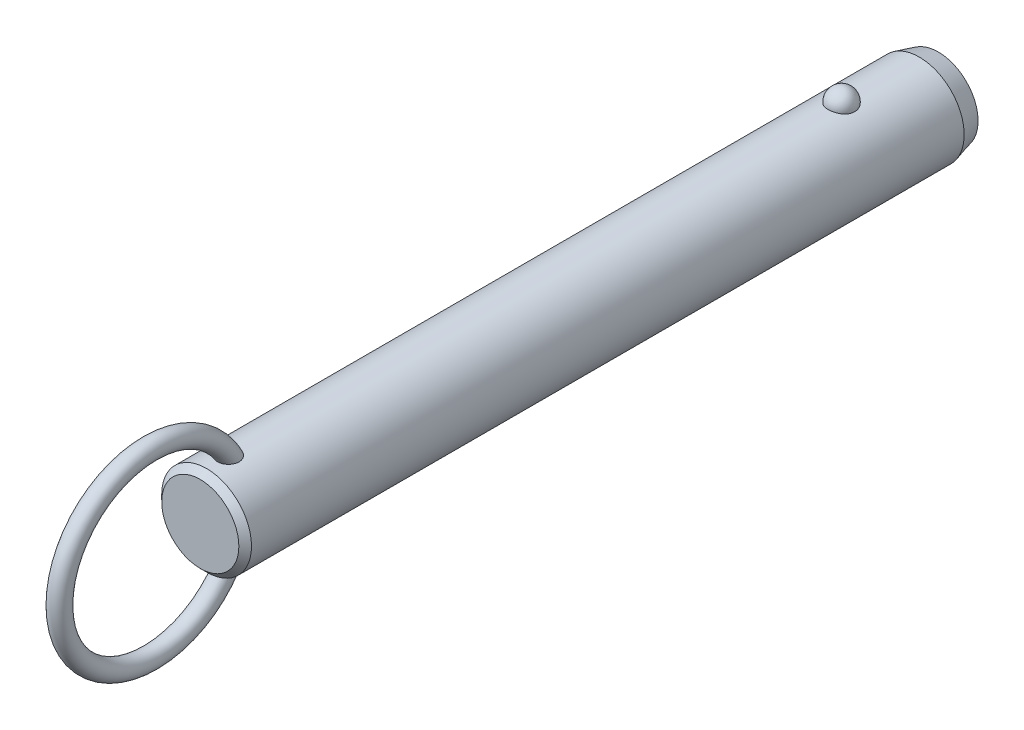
ISO-10303-21;
HEADER;
FILE_DESCRIPTION(('STEP AP214'),'2;1');
FILE_NAME('part.step','',(''),(''),'','','');
FILE_SCHEMA(('AUTOMOTIVE_DESIGN { 1 0 10303 214 1 1 1 1 }'));
ENDSEC;
DATA;
#1=APPLICATION_CONTEXT('core data for automotive mechanical design processes');
#2=APPLICATION_PROTOCOL_DEFINITION('international standard','automotive_design',2000,#1);
#3=PRODUCT_CONTEXT('',#1,'mechanical');
#4=PRODUCT('Part','Part','',(#3));
#5=PRODUCT_RELATED_PRODUCT_CATEGORY('part','',(#4));
#6=PRODUCT_DEFINITION_FORMATION('','',#4);
#7=PRODUCT_DEFINITION_CONTEXT('part definition',#1,'design');
#8=PRODUCT_DEFINITION('design','',#6,#7);
#9=PRODUCT_DEFINITION_SHAPE('','',#8);
#10=(LENGTH_UNIT() NAMED_UNIT(*) SI_UNIT(.MILLI.,.METRE.));
#11=(NAMED_UNIT(*) PLANE_ANGLE_UNIT() SI_UNIT($,.RADIAN.));
#12=(NAMED_UNIT(*) SI_UNIT($,.STERADIAN.) SOLID_ANGLE_UNIT());
#13=UNCERTAINTY_MEASURE_WITH_UNIT(LENGTH_MEASURE(1.E-05),#10,'distance_accuracy_value','');
#14=(GEOMETRIC_REPRESENTATION_CONTEXT(3) GLOBAL_UNCERTAINTY_ASSIGNED_CONTEXT((#13)) GLOBAL_UNIT_ASSIGNED_CONTEXT((#10,
#11,#12)) REPRESENTATION_CONTEXT('',''));
#15=CARTESIAN_POINT('',(0.,0.,0.));
#16=DIRECTION('',(0.,0.,1.));
#17=DIRECTION('',(1.,0.,0.));
#18=AXIS2_PLACEMENT_3D('',#15,#16,#17);
#19=CARTESIAN_POINT('',(0.,0.,91.4));
#20=DIRECTION('',(0.,0.,-1.));
#21=DIRECTION('',(-1.,0.,0.));
#22=AXIS2_PLACEMENT_3D('',#19,#20,#21);
#23=CYLINDRICAL_SURFACE('',#22,7.1);
#24=CARTESIAN_POINT('',(2.0769088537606,6.78943661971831,-2.1));
#25=CARTESIAN_POINT('',(2.07690739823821,6.78943796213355,-1.98268154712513));
#26=CARTESIAN_POINT('',(2.06738130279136,6.79237331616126,-1.86534506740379));
#27=CARTESIAN_POINT('',(2.0295040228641,6.8037853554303,-1.63400788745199));
#28=CARTESIAN_POINT('',(2.00114757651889,6.81226358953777,-1.52000812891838));
#29=CARTESIAN_POINT('',(1.92632025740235,6.83379798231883,-1.29863433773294));
#30=CARTESIAN_POINT('',(1.87985726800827,6.84685214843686,-1.19125744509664));
#31=CARTESIAN_POINT('',(1.76995205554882,6.87608091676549,-0.986046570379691));
#32=CARTESIAN_POINT('',(1.70650980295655,6.8922555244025,-0.888212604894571));
#33=CARTESIAN_POINT('',(1.56381192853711,6.92602930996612,-0.704242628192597));
#34=CARTESIAN_POINT('',(1.4844714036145,6.94363582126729,-0.618173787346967));
#35=CARTESIAN_POINT('',(1.31221746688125,6.97823658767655,-0.460740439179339));
#36=CARTESIAN_POINT('',(1.21930409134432,6.99523084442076,-0.389375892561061));
#37=CARTESIAN_POINT('',(1.02268781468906,7.02666176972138,-0.263547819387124));
#38=CARTESIAN_POINT('',(0.919020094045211,7.04110638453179,-0.209031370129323));
#39=CARTESIAN_POINT('',(0.703548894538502,7.06588726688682,-0.118163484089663));
#40=CARTESIAN_POINT('',(0.591746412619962,7.07622403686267,-0.0818098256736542));
#41=CARTESIAN_POINT('',(0.365557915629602,7.09147068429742,-0.028871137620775));
#42=CARTESIAN_POINT('',(0.251267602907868,7.09648447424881,-0.0119070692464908));
#43=CARTESIAN_POINT('',(0.0213499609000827,7.10089837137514,0.00304925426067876));
#44=CARTESIAN_POINT('',(-0.0942772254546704,7.10029907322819,0.00104351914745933));
#45=CARTESIAN_POINT('',(-0.321651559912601,7.09360829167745,-0.0216931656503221));
#46=CARTESIAN_POINT('',(-0.433431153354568,7.08760388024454,-0.0421272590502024));
#47=CARTESIAN_POINT('',(-0.651862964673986,7.07086131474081,-0.100729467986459));
#48=CARTESIAN_POINT('',(-0.758515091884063,7.06012307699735,-0.138897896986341));
#49=CARTESIAN_POINT('',(-0.964449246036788,7.03496097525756,-0.232213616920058));
#50=CARTESIAN_POINT('',(-1.06368095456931,7.02051445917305,-0.287465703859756));
#51=CARTESIAN_POINT('',(-1.25145353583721,6.98948740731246,-0.413383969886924));
#52=CARTESIAN_POINT('',(-1.33999321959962,6.97290663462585,-0.484051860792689));
#53=CARTESIAN_POINT('',(-1.50591604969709,6.93898770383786,-0.640594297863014));
#54=CARTESIAN_POINT('',(-1.58302488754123,6.92164094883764,-0.726757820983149));
#55=CARTESIAN_POINT('',(-1.72189320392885,6.8884103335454,-0.910927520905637));
#56=CARTESIAN_POINT('',(-1.78365144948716,6.87252659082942,-1.008934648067));
#57=CARTESIAN_POINT('',(-1.89101272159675,6.84377189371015,-1.21549497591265));
#58=CARTESIAN_POINT('',(-1.93639553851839,6.83094274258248,-1.32416860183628));
#59=CARTESIAN_POINT('',(-2.00874275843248,6.81002070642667,-1.54791500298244));
#60=CARTESIAN_POINT('',(-2.03570774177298,6.80192767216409,-1.66298757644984));
#61=CARTESIAN_POINT('',(-2.07047276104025,6.7914266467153,-1.89571453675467));
#62=CARTESIAN_POINT('',(-2.07835878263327,6.78899315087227,-2.01335491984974));
#63=CARTESIAN_POINT('',(-2.07502083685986,6.79001409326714,-2.24833570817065));
#64=CARTESIAN_POINT('',(-2.06379746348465,6.7934683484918,-2.36567612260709));
#65=CARTESIAN_POINT('',(-2.02263913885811,6.80583442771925,-2.59603194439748));
#66=CARTESIAN_POINT('',(-1.99281127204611,6.81471501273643,-2.70906820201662));
#67=CARTESIAN_POINT('',(-1.91526639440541,6.83691232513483,-2.92836575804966));
#68=CARTESIAN_POINT('',(-1.8675486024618,6.85022924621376,-3.03462676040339));
#69=CARTESIAN_POINT('',(-1.75504492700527,6.87991336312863,-3.23806487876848));
#70=CARTESIAN_POINT('',(-1.69015924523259,6.89629822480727,-3.33518422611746));
#71=CARTESIAN_POINT('',(-1.54505404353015,6.93024852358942,-3.51697105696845));
#72=CARTESIAN_POINT('',(-1.46483385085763,6.94781401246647,-3.60163799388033));
#73=CARTESIAN_POINT('',(-1.29071406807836,6.98225977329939,-3.75654119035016));
#74=CARTESIAN_POINT('',(-1.19675650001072,6.99913673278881,-3.82671308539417));
#75=CARTESIAN_POINT('',(-0.997940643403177,7.03023618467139,-3.9501837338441));
#76=CARTESIAN_POINT('',(-0.893083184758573,7.04445887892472,-4.00348377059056));
#77=CARTESIAN_POINT('',(-0.676902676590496,7.06848365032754,-4.09107242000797));
#78=CARTESIAN_POINT('',(-0.565686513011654,7.0783430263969,-4.12560889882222));
#79=CARTESIAN_POINT('',(-0.338739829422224,7.09282534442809,-4.17575450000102));
#80=CARTESIAN_POINT('',(-0.223009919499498,7.09744899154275,-4.19136617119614));
#81=CARTESIAN_POINT('',(0.00707628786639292,7.10090930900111,-4.20307965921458));
#82=CARTESIAN_POINT('',(0.121410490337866,7.09986531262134,-4.19958377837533));
#83=CARTESIAN_POINT('',(0.34781544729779,7.092380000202,-4.17411564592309));
#84=CARTESIAN_POINT('',(0.459886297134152,7.08593891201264,-4.15214417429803));
#85=CARTESIAN_POINT('',(0.678084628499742,7.06838983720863,-4.09049562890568));
#86=CARTESIAN_POINT('',(0.784237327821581,7.05730369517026,-4.05090137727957));
#87=CARTESIAN_POINT('',(0.988305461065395,7.03163139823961,-3.95511447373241));
#88=CARTESIAN_POINT('',(1.08622031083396,7.01704499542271,-3.89892064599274));
#89=CARTESIAN_POINT('',(1.27284490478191,6.98562668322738,-3.77035541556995));
#90=CARTESIAN_POINT('',(1.36137372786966,6.96876135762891,-3.69772964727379));
#91=CARTESIAN_POINT('',(1.52509486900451,6.93477412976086,-3.53878279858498));
#92=CARTESIAN_POINT('',(1.60028496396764,6.91765218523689,-3.45245943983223));
#93=CARTESIAN_POINT('',(1.73681688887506,6.88465753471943,-3.26658774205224));
#94=CARTESIAN_POINT('',(1.79785966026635,6.86881574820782,-3.16681408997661));
#95=CARTESIAN_POINT('',(1.90265327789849,6.84053157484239,-2.95814408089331));
#96=CARTESIAN_POINT('',(1.94640861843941,6.82808830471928,-2.84925010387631));
#97=CARTESIAN_POINT('',(2.01274378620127,6.80881460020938,-2.63454318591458));
#98=CARTESIAN_POINT('',(2.03676193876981,6.80160856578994,-2.52920574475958));
#99=CARTESIAN_POINT('',(2.06884490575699,6.79191902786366,-2.3159172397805));
#100=CARTESIAN_POINT('',(2.07691019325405,6.78943538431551,-2.20796625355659));
#101=CARTESIAN_POINT('',(2.0769088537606,6.78943661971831,-2.1));
#102=B_SPLINE_CURVE_WITH_KNOTS('',3,(#24,#25,#26,#27,#28,#29,#30,#31,#32,#33,#34,#35,#36,#37,
#38,#39,#40,#41,#42,#43,#44,#45,#46,#47,#48,#49,#50,#51,#52,#53,#54,#55,#56,#57,#58,#59,#60,#61,
#62,#63,#64,#65,#66,#67,#68,#69,#70,#71,#72,#73,#74,#75,#76,#77,#78,#79,#80,#81,#82,#83,#84,#85,
#86,#87,#88,#89,#90,#91,#92,#93,#94,#95,#96,#97,#98,#99,#100,#101),.UNSPECIFIED.,.T.,.F.,(4,2,2,
2,2,2,2,2,2,2,2,2,2,2,2,2,2,2,2,2,2,2,2,2,2,2,2,2,2,2,2,2,2,2,2,2,2,2,4),(0.,0.351568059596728,
0.703234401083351,1.05474780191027,1.40626181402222,1.75970563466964,2.11314851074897,
2.4654696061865,2.81774759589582,3.16301449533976,3.50824481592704,3.84801136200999,
4.18778391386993,4.52968352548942,4.87162112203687,5.22076181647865,5.56993054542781,
5.92363364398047,6.27732559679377,6.62942052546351,6.98150450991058,7.33158042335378,
7.68167162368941,8.03384443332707,8.38603269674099,8.73975272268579,9.09344583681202,
9.44234545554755,9.79119807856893,10.1327344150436,10.4742563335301,10.8141898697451,
11.1541474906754,11.4997793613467,11.8454687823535,12.1979079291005,12.5502553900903,
12.8738073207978,13.1973496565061),.UNSPECIFIED.);
#103=CARTESIAN_POINT('',(2.0769088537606,6.78943661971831,-2.1));
#104=VERTEX_POINT('',#103);
#105=EDGE_CURVE('E41',#104,#104,#102,.T.);
#106=ORIENTED_EDGE('',*,*,#105,.T.);
#107=EDGE_LOOP('',(#106));
#108=FACE_BOUND('',#107,.T.);
#109=CARTESIAN_POINT('',(0.,0.,98.3200000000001));
#110=DIRECTION('',(0.,0.,1.));
#111=DIRECTION('',(1.,0.,0.));
#112=AXIS2_PLACEMENT_3D('',#109,#110,#111);
#113=CIRCLE('',#112,7.1);
#114=CARTESIAN_POINT('',(7.1,0.,98.3200000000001));
#115=VERTEX_POINT('',#114);
#116=EDGE_CURVE('E10',#115,#115,#113,.F.);
#117=ORIENTED_EDGE('',*,*,#116,.T.);
#118=EDGE_LOOP('',(#117));
#119=FACE_BOUND('',#118,.T.);
#120=CARTESIAN_POINT('',(-0.429539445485,-7.08699541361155,93.1429212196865));
#121=CARTESIAN_POINT('',(-0.508331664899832,-7.08221999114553,93.1668764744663));
#122=CARTESIAN_POINT('',(-0.58503984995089,-7.07624016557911,93.1974570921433));
#123=CARTESIAN_POINT('',(-0.732082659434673,-7.06254296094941,93.2710242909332));
#124=CARTESIAN_POINT('',(-0.802417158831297,-7.05482554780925,93.3140111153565));
#125=CARTESIAN_POINT('',(-0.934722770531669,-7.03851844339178,93.4111135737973));
#126=CARTESIAN_POINT('',(-0.99670020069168,-7.02992941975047,93.4652207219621));
#127=CARTESIAN_POINT('',(-1.11079942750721,-7.01280697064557,93.5829676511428));
#128=CARTESIAN_POINT('',(-1.16292136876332,-7.00427354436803,93.6466072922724));
#129=CARTESIAN_POINT('',(-1.25705660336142,-6.98799959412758,93.7826870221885));
#130=CARTESIAN_POINT('',(-1.29888032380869,-6.98027525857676,93.8552598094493));
#131=CARTESIAN_POINT('',(-1.37069920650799,-6.96652886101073,94.0061686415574));
#132=CARTESIAN_POINT('',(-1.40069157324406,-6.96050720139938,94.0845060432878));
#133=CARTESIAN_POINT('',(-1.45043507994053,-6.95031881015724,94.2501903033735));
#134=CARTESIAN_POINT('',(-1.46937115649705,-6.94630231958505,94.3377897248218));
#135=CARTESIAN_POINT('',(-1.49424917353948,-6.94099239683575,94.5148714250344));
#136=CARTESIAN_POINT('',(-1.50018601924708,-6.93970003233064,94.6043544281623));
#137=CARTESIAN_POINT('',(-1.49978214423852,-6.93978815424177,94.7940607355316));
#138=CARTESIAN_POINT('',(-1.49187639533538,-6.94150934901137,94.894279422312));
#139=CARTESIAN_POINT('',(-1.46177925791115,-6.94790814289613,95.0924798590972));
#140=CARTESIAN_POINT('',(-1.43957541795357,-6.95258831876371,95.190459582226));
#141=CARTESIAN_POINT('',(-1.37783293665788,-6.96510647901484,95.3953629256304));
#142=CARTESIAN_POINT('',(-1.33634073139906,-6.97328848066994,95.5016801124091));
#143=CARTESIAN_POINT('',(-1.23686994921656,-6.99161706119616,95.7061777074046));
#144=CARTESIAN_POINT('',(-1.17889192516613,-7.00176357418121,95.8043583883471));
#145=CARTESIAN_POINT('',(-1.0587512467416,-7.02082898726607,95.9723743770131));
#146=CARTESIAN_POINT('',(-0.999247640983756,-7.02963746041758,96.0441230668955));
#147=CARTESIAN_POINT('',(-0.869494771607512,-7.04686074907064,96.1771959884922));
#148=CARTESIAN_POINT('',(-0.799263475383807,-7.05527619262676,96.2385372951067));
#149=CARTESIAN_POINT('',(-0.665408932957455,-7.06899457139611,96.3351316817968));
#150=CARTESIAN_POINT('',(-0.603817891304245,-7.07457275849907,96.3731512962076));
#151=CARTESIAN_POINT('',(-0.47517283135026,-7.08437420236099,96.4387581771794));
#152=CARTESIAN_POINT('',(-0.408123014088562,-7.08859848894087,96.4663533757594));
#153=CARTESIAN_POINT('',(-0.269431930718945,-7.09522749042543,96.5092569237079));
#154=CARTESIAN_POINT('',(-0.197757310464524,-7.09761688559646,96.5244618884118));
#155=CARTESIAN_POINT('',(-0.0527849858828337,-7.10017268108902,96.5407168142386));
#156=CARTESIAN_POINT('',(0.0205115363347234,-7.10034065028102,96.5417767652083));
#157=CARTESIAN_POINT('',(0.156426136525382,-7.09855986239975,96.5304619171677));
#158=CARTESIAN_POINT('',(0.219199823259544,-7.09688191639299,96.5198060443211));
#159=CARTESIAN_POINT('',(0.342134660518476,-7.09201880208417,96.4885379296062));
#160=CARTESIAN_POINT('',(0.402295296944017,-7.08883333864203,96.4679237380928));
#161=CARTESIAN_POINT('',(0.520687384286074,-7.08113868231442,96.4172125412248));
#162=CARTESIAN_POINT('',(0.578791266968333,-7.07658958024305,96.3868272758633));
#163=CARTESIAN_POINT('',(0.690173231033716,-7.06659708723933,96.3183678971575));
#164=CARTESIAN_POINT('',(0.743447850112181,-7.061153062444,96.2802883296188));
#165=CARTESIAN_POINT('',(0.870947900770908,-7.04680292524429,96.1765929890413));
#166=CARTESIAN_POINT('',(0.941828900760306,-7.0375580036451,96.1068972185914));
#167=CARTESIAN_POINT('',(1.07136606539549,-7.01900793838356,95.9569450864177));
#168=CARTESIAN_POINT('',(1.13000013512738,-7.00970271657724,95.8766700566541));
#169=CARTESIAN_POINT('',(1.23579584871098,-6.99183327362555,95.7068997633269));
#170=CARTESIAN_POINT('',(1.2827427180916,-6.98328455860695,95.6172696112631));
#171=CARTESIAN_POINT('',(1.36351442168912,-6.96796352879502,95.4321763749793));
#172=CARTESIAN_POINT('',(1.39733971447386,-6.96119115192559,95.3367134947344));
#173=CARTESIAN_POINT('',(1.45579181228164,-6.94922464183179,95.1253092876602));
#174=CARTESIAN_POINT('',(1.47790145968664,-6.94449000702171,95.008631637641));
#175=CARTESIAN_POINT('',(1.50168752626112,-6.93938731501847,94.7730153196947));
#176=CARTESIAN_POINT('',(1.50336085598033,-6.93901991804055,94.6540763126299));
#177=CARTESIAN_POINT('',(1.48486516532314,-6.9430010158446,94.4236079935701));
#178=CARTESIAN_POINT('',(1.46573441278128,-6.9471253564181,94.3119958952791));
#179=CARTESIAN_POINT('',(1.40606892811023,-6.95944667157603,94.0948868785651));
#180=CARTESIAN_POINT('',(1.36556446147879,-6.96763788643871,93.9893815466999));
#181=CARTESIAN_POINT('',(1.27082700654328,-6.98548038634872,93.8042879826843));
#182=CARTESIAN_POINT('',(1.21949810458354,-6.99473841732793,93.7231719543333));
#183=CARTESIAN_POINT('',(1.10242050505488,-7.01414069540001,93.5722278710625));
#184=CARTESIAN_POINT('',(1.03668119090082,-7.02428436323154,93.5023925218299));
#185=CARTESIAN_POINT('',(0.900559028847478,-7.04295285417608,93.3835735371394));
#186=CARTESIAN_POINT('',(0.83142884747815,-7.05153466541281,93.3331573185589));
#187=CARTESIAN_POINT('',(0.68529187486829,-7.06723150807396,93.2451429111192));
#188=CARTESIAN_POINT('',(0.608287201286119,-7.0743469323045,93.2075412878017));
#189=CARTESIAN_POINT('',(0.451878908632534,-7.08602232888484,93.1474915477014));
#190=CARTESIAN_POINT('',(0.372686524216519,-7.09067127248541,93.1245088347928));
#191=CARTESIAN_POINT('',(0.211477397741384,-7.09730788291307,93.0920357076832));
#192=CARTESIAN_POINT('',(0.129460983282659,-7.09929585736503,93.0825437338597));
#193=CARTESIAN_POINT('',(-0.0332905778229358,-7.10037858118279,93.0773517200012));
#194=CARTESIAN_POINT('',(-0.114016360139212,-7.09953334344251,93.0813656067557));
#195=CARTESIAN_POINT('',(-0.273670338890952,-7.09517338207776,93.1024540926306));
#196=CARTESIAN_POINT('',(-0.352598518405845,-7.09165863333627,93.1195288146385));
#197=CARTESIAN_POINT('',(-0.429539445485,-7.08699541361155,93.1429212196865));
#198=B_SPLINE_CURVE_WITH_KNOTS('',3,(#120,#121,#122,#123,#124,#125,#126,#127,#128,#129,#130,
#131,#132,#133,#134,#135,#136,#137,#138,#139,#140,#141,#142,#143,#144,#145,#146,#147,#148,#149,
#150,#151,#152,#153,#154,#155,#156,#157,#158,#159,#160,#161,#162,#163,#164,#165,#166,#167,#168,
#169,#170,#171,#172,#173,#174,#175,#176,#177,#178,#179,#180,#181,#182,#183,#184,#185,#186,#187,
#188,#189,#190,#191,#192,#193,#194,#195,#196,#197),.UNSPECIFIED.,.T.,.F.,(4,2,2,2,2,2,2,2,2,2,2,
2,2,2,2,2,2,2,2,2,2,2,2,2,2,2,2,2,2,2,2,2,2,2,2,2,2,2,4),(0.,0.247183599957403,
0.494372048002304,0.741372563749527,0.988369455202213,1.23962059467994,1.49093106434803,
1.75897818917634,2.02713035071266,2.32758265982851,2.62829697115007,2.97008736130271,
3.31186629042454,3.59175319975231,3.87117637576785,4.08813841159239,4.30493502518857,
4.52352259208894,4.74195577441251,4.9321532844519,5.12238804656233,5.31884850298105,
5.51544871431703,5.81332317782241,6.11173048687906,6.4152726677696,6.71880423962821,
7.073581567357,7.42841252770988,7.76631485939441,8.10373999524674,8.39142246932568,
8.67891817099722,8.93560332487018,9.19221962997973,9.43881106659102,9.68537399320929,
9.92674752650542,10.1681233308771),.UNSPECIFIED.);
#199=CARTESIAN_POINT('',(-0.429539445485,-7.08699541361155,93.1429212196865));
#200=VERTEX_POINT('',#199);
#201=EDGE_CURVE('E59',#200,#200,#198,.T.);
#202=ORIENTED_EDGE('',*,*,#201,.T.);
#203=EDGE_LOOP('',(#202));
#204=FACE_BOUND('',#203,.T.);
#205=CARTESIAN_POINT('',(-0.429539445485,7.08699541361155,93.1429212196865));
#206=CARTESIAN_POINT('',(-0.351665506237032,7.09171429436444,93.1192469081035));
#207=CARTESIAN_POINT('',(-0.271733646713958,7.09525896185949,93.1020369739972));
#208=CARTESIAN_POINT('',(-0.110026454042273,7.09960839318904,93.0810059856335));
#209=CARTESIAN_POINT('',(-0.0282502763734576,7.10041187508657,93.077191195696));
#210=CARTESIAN_POINT('',(0.134782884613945,7.09918849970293,93.083059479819));
#211=CARTESIAN_POINT('',(0.216039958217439,7.09716214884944,93.0927401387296));
#212=CARTESIAN_POINT('',(0.375730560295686,7.09050177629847,93.1253471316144));
#213=CARTESIAN_POINT('',(0.454164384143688,7.08586802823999,93.1482720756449));
#214=CARTESIAN_POINT('',(0.606025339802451,7.07449911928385,93.2067718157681));
#215=CARTESIAN_POINT('',(0.679451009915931,7.06776334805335,93.2423502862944));
#216=CARTESIAN_POINT('',(0.819234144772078,7.05292866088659,93.3251753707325));
#217=CARTESIAN_POINT('',(0.88559181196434,7.04482978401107,93.3724216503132));
#218=CARTESIAN_POINT('',(1.00993211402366,7.02808709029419,93.4775902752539));
#219=CARTESIAN_POINT('',(1.06785399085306,7.01943990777,93.535583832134));
#220=CARTESIAN_POINT('',(1.17342527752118,7.00256662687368,93.6603013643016));
#221=CARTESIAN_POINT('',(1.22107408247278,6.99434055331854,93.7270258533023));
#222=CARTESIAN_POINT('',(1.30652927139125,6.97889183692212,93.8693622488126));
#223=CARTESIAN_POINT('',(1.34399711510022,6.97170674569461,93.9451808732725));
#224=CARTESIAN_POINT('',(1.40682616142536,6.95930080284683,94.1018100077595));
#225=CARTESIAN_POINT('',(1.43218374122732,6.95408053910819,94.1826220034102));
#226=CARTESIAN_POINT('',(1.47246409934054,6.94566853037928,94.3535314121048));
#227=CARTESIAN_POINT('',(1.48642590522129,6.9426653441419,94.4438630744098));
#228=CARTESIAN_POINT('',(1.5011410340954,6.93949744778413,94.625619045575));
#229=CARTESIAN_POINT('',(1.50188917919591,6.93933385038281,94.7170437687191));
#230=CARTESIAN_POINT('',(1.49030464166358,6.94183245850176,94.9108438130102));
#231=CARTESIAN_POINT('',(1.47627413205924,6.94486147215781,95.013112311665));
#232=CARTESIAN_POINT('',(1.43356351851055,6.95380194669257,95.2144719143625));
#233=CARTESIAN_POINT('',(1.4048676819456,6.95971650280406,95.3135594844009));
#234=CARTESIAN_POINT('',(1.32908750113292,6.97461208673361,95.5189087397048));
#235=CARTESIAN_POINT('',(1.28011435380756,6.98388945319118,95.6244566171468));
#236=CARTESIAN_POINT('',(1.16520357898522,7.00397743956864,95.8257604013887));
#237=CARTESIAN_POINT('',(1.09927694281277,7.01478706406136,95.9215225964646));
#238=CARTESIAN_POINT('',(0.969361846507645,7.03373936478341,96.0767565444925));
#239=CARTESIAN_POINT('',(0.909042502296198,7.04187023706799,96.1393032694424));
#240=CARTESIAN_POINT('',(0.77917855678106,7.0574173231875,96.2540535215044));
#241=CARTESIAN_POINT('',(0.70964977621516,7.06483472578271,96.3062744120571));
#242=CARTESIAN_POINT('',(0.576854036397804,7.0767751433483,96.3881138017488));
#243=CARTESIAN_POINT('',(0.515118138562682,7.08158033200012,96.4201641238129));
#244=CARTESIAN_POINT('',(0.387127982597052,7.08972701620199,96.4737656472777));
#245=CARTESIAN_POINT('',(0.320877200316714,7.09306962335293,96.4953248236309));
#246=CARTESIAN_POINT('',(0.185041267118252,7.09791507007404,96.5264005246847));
#247=CARTESIAN_POINT('',(0.115437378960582,7.09940591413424,96.5358385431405));
#248=CARTESIAN_POINT('',(-0.0243157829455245,7.10030171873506,96.5415226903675));
#249=CARTESIAN_POINT('',(-0.094464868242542,7.0997073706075,96.5377731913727));
#250=CARTESIAN_POINT('',(-0.225713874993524,7.09668414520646,96.5185081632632));
#251=CARTESIAN_POINT('',(-0.287006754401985,7.09444865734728,96.5042323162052));
#252=CARTESIAN_POINT('',(-0.406555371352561,7.08860360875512,96.4663685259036));
#253=CARTESIAN_POINT('',(-0.464809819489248,7.08499346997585,96.4427766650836));
#254=CARTESIAN_POINT('',(-0.594955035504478,7.07541654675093,96.3789232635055));
#255=CARTESIAN_POINT('',(-0.665389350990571,7.06906574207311,96.335753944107));
#256=CARTESIAN_POINT('',(-0.798242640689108,7.05530261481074,96.238587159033));
#257=CARTESIAN_POINT('',(-0.860645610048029,7.0478882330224,96.1845686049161));
#258=CARTESIAN_POINT('',(-0.994249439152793,7.03045217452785,96.0509965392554));
#259=CARTESIAN_POINT('',(-1.06260129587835,7.02030745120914,95.9686143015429));
#260=CARTESIAN_POINT('',(-1.18502045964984,7.00068382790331,95.793843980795));
#261=CARTESIAN_POINT('',(-1.23907684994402,6.99120544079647,95.701448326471));
#262=CARTESIAN_POINT('',(-1.33335589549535,6.97384343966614,95.5080085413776));
#263=CARTESIAN_POINT('',(-1.37336138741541,6.96598557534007,95.4068564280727));
#264=CARTESIAN_POINT('',(-1.43770677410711,6.9529905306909,95.1995046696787));
#265=CARTESIAN_POINT('',(-1.46204473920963,6.94785368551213,95.09330440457));
#266=CARTESIAN_POINT('',(-1.49537533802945,6.94076296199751,94.8682317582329));
#267=CARTESIAN_POINT('',(-1.50273564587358,6.93914842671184,94.7490975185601));
#268=CARTESIAN_POINT('',(-1.4954555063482,6.94072368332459,94.5114703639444));
#269=CARTESIAN_POINT('',(-1.48082914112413,6.94391040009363,94.3929770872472));
#270=CARTESIAN_POINT('',(-1.43076401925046,6.95438579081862,94.1734325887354));
#271=CARTESIAN_POINT('',(-1.39762227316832,6.96121852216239,94.0718413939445));
#272=CARTESIAN_POINT('',(-1.31211274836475,6.97783941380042,93.8773513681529));
#273=CARTESIAN_POINT('',(-1.25976607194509,6.98762432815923,93.7844431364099));
#274=CARTESIAN_POINT('',(-1.14583073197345,7.00713153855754,93.6241601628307));
#275=CARTESIAN_POINT('',(-1.0866594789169,7.01665982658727,93.5550351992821));
#276=CARTESIAN_POINT('',(-0.956606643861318,7.03556646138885,93.4288786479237));
#277=CARTESIAN_POINT('',(-0.885737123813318,7.04494495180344,93.3718347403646));
#278=CARTESIAN_POINT('',(-0.751558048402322,7.06035735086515,93.2831004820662));
#279=CARTESIAN_POINT('',(-0.690120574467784,7.0666695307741,93.2485932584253));
#280=CARTESIAN_POINT('',(-0.562815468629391,7.07794609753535,93.1887507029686));
#281=CARTESIAN_POINT('',(-0.496948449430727,7.08291067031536,93.1634141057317));
#282=CARTESIAN_POINT('',(-0.429539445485,7.08699541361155,93.1429212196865));
#283=B_SPLINE_CURVE_WITH_KNOTS('',3,(#205,#206,#207,#208,#209,#210,#211,#212,#213,#214,#215,
#216,#217,#218,#219,#220,#221,#222,#223,#224,#225,#226,#227,#228,#229,#230,#231,#232,#233,#234,
#235,#236,#237,#238,#239,#240,#241,#242,#243,#244,#245,#246,#247,#248,#249,#250,#251,#252,#253,
#254,#255,#256,#257,#258,#259,#260,#261,#262,#263,#264,#265,#266,#267,#268,#269,#270,#271,#272,
#273,#274,#275,#276,#277,#278,#279,#280,#281,#282),.UNSPECIFIED.,.T.,.F.,(4,2,2,2,2,2,2,2,2,2,2,
2,2,2,2,2,2,2,2,2,2,2,2,2,2,2,2,2,2,2,2,2,2,2,2,2,2,2,4),(0.,0.244335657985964,
0.488785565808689,0.733191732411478,0.977572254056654,1.22202379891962,1.46646834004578,
1.71259457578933,1.95873529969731,2.21226768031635,2.46587585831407,2.7391381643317,
3.01250754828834,3.32109936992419,3.63002293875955,3.97863512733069,4.32702187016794,
4.5879394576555,4.84841449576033,5.05676704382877,5.26496096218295,5.47449661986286,
5.68396281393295,5.8720544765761,6.06022532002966,6.30743751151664,6.55513496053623,
6.87602468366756,7.19715875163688,7.52305774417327,7.84899686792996,8.20516155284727,
8.56109821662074,8.88040084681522,9.19935367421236,9.47236282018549,9.74509220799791,
9.95662250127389,10.1681235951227),.UNSPECIFIED.);
#284=CARTESIAN_POINT('',(-0.429539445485,7.08699541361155,93.1429212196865));
#285=VERTEX_POINT('',#284);
#286=EDGE_CURVE('E67',#285,#285,#283,.T.);
#287=ORIENTED_EDGE('',*,*,#286,.T.);
#288=EDGE_LOOP('',(#287));
#289=FACE_BOUND('',#288,.T.);
#290=CARTESIAN_POINT('',(0.,0.,-14.4000000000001));
#291=DIRECTION('',(0.,0.,-1.));
#292=DIRECTION('',(-1.,0.,0.));
#293=AXIS2_PLACEMENT_3D('',#290,#291,#292);
#294=CIRCLE('',#293,7.1);
#295=CARTESIAN_POINT('',(-7.1,0.,-14.4000000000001));
#296=VERTEX_POINT('',#295);
#297=EDGE_CURVE('E56',#296,#296,#294,.F.);
#298=ORIENTED_EDGE('',*,*,#297,.T.);
#299=EDGE_LOOP('',(#298));
#300=FACE_BOUND('',#299,.T.);
#301=ADVANCED_FACE('F37',(#108,#119,#204,#289,#300),#23,.T.);
#302=CARTESIAN_POINT('',(0.,0.,-17.4));
#303=DIRECTION('',(0.,0.,-1.));
#304=DIRECTION('',(-1.,0.,0.));
#305=AXIS2_PLACEMENT_3D('',#302,#303,#304);
#306=PLANE('',#305);
#307=CARTESIAN_POINT('',(0.,0.,-17.4));
#308=DIRECTION('',(0.,0.,-1.));
#309=DIRECTION('',(-1.,0.,0.));
#310=AXIS2_PLACEMENT_3D('',#307,#308,#309);
#311=CIRCLE('',#310,6.29615242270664);
#312=CARTESIAN_POINT('',(-6.29615242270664,0.,-17.4));
#313=VERTEX_POINT('',#312);
#314=EDGE_CURVE('E66',#313,#313,#311,.T.);
#315=ORIENTED_EDGE('',*,*,#314,.T.);
#316=EDGE_LOOP('',(#315));
#317=FACE_BOUND('',#316,.T.);
#318=ADVANCED_FACE('F85',(#317),#306,.T.);
#319=CARTESIAN_POINT('',(0.,0.,-17.4));
#320=DIRECTION('',(0.,0.,1.));
#321=DIRECTION('',(1.,0.,0.));
#322=AXIS2_PLACEMENT_3D('',#319,#320,#321);
#323=CONICAL_SURFACE('',#322,6.29615242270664,0.261799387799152);
#324=ORIENTED_EDGE('',*,*,#297,.F.);
#325=EDGE_LOOP('',(#324));
#326=FACE_BOUND('',#325,.T.);
#327=ORIENTED_EDGE('',*,*,#314,.F.);
#328=EDGE_LOOP('',(#327));
#329=FACE_BOUND('',#328,.T.);
#330=ADVANCED_FACE('F83',(#326,#329),#323,.T.);
#331=CARTESIAN_POINT('',(0.,0.,99.32));
#332=DIRECTION('',(0.,0.,1.));
#333=DIRECTION('',(1.,0.,0.));
#334=AXIS2_PLACEMENT_3D('',#331,#332,#333);
#335=PLANE('',#334);
#336=CARTESIAN_POINT('',(0.,0.,99.32));
#337=DIRECTION('',(0.,0.,1.));
#338=DIRECTION('',(1.,0.,0.));
#339=AXIS2_PLACEMENT_3D('',#336,#337,#338);
#340=CIRCLE('',#339,6.10000000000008);
#341=CARTESIAN_POINT('',(6.10000000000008,0.,99.32));
#342=VERTEX_POINT('',#341);
#343=EDGE_CURVE('E50',#342,#342,#340,.T.);
#344=ORIENTED_EDGE('',*,*,#343,.T.);
#345=EDGE_LOOP('',(#344));
#346=FACE_BOUND('',#345,.T.);
#347=ADVANCED_FACE('F77',(#346),#335,.T.);
#348=CARTESIAN_POINT('',(0.,0.,107.25));
#349=DIRECTION('',(1.,0.,0.));
#350=DIRECTION('',(0.,0.,-1.));
#351=AXIS2_PLACEMENT_3D('',#348,#349,#350);
#352=TOROIDAL_SURFACE('',#351,14.35,1.5);
#353=ORIENTED_EDGE('',*,*,#286,.F.);
#354=EDGE_LOOP('',(#353));
#355=FACE_BOUND('',#354,.T.);
#356=ORIENTED_EDGE('',*,*,#201,.F.);
#357=EDGE_LOOP('',(#356));
#358=FACE_BOUND('',#357,.T.);
#359=ADVANCED_FACE('F73',(#355,#358),#352,.T.);
#360=CARTESIAN_POINT('',(0.,0.,99.32));
#361=DIRECTION('',(0.,0.,-1.));
#362=DIRECTION('',(-1.,0.,0.));
#363=AXIS2_PLACEMENT_3D('',#360,#361,#362);
#364=CONICAL_SURFACE('',#363,6.10000000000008,0.785398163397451);
#365=ORIENTED_EDGE('',*,*,#116,.F.);
#366=EDGE_LOOP('',(#365));
#367=FACE_BOUND('',#366,.T.);
#368=ORIENTED_EDGE('',*,*,#343,.F.);
#369=EDGE_LOOP('',(#368));
#370=FACE_BOUND('',#369,.T.);
#371=ADVANCED_FACE('F39',(#367,#370),#364,.T.);
#372=CARTESIAN_POINT('',(0.,7.1,-2.1));
#373=DIRECTION('',(0.,1.,0.));
#374=DIRECTION('',(0.,0.,1.));
#375=AXIS2_PLACEMENT_3D('',#372,#373,#374);
#376=SPHERICAL_SURFACE('',#375,2.10000000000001);
#377=ORIENTED_EDGE('',*,*,#105,.F.);
#378=EDGE_LOOP('',(#377));
#379=FACE_BOUND('',#378,.T.);
#380=ADVANCED_FACE('F79',(#379),#376,.T.);
#381=CLOSED_SHELL('',(#301,#318,#330,#347,#359,#371,#380));
#382=MANIFOLD_SOLID_BREP('B2',#381);
#383=ADVANCED_BREP_SHAPE_REPRESENTATION('',(#18,#382),#14);
#384=SHAPE_DEFINITION_REPRESENTATION(#9,#383);
ENDSEC;
END-ISO-10303-21;
